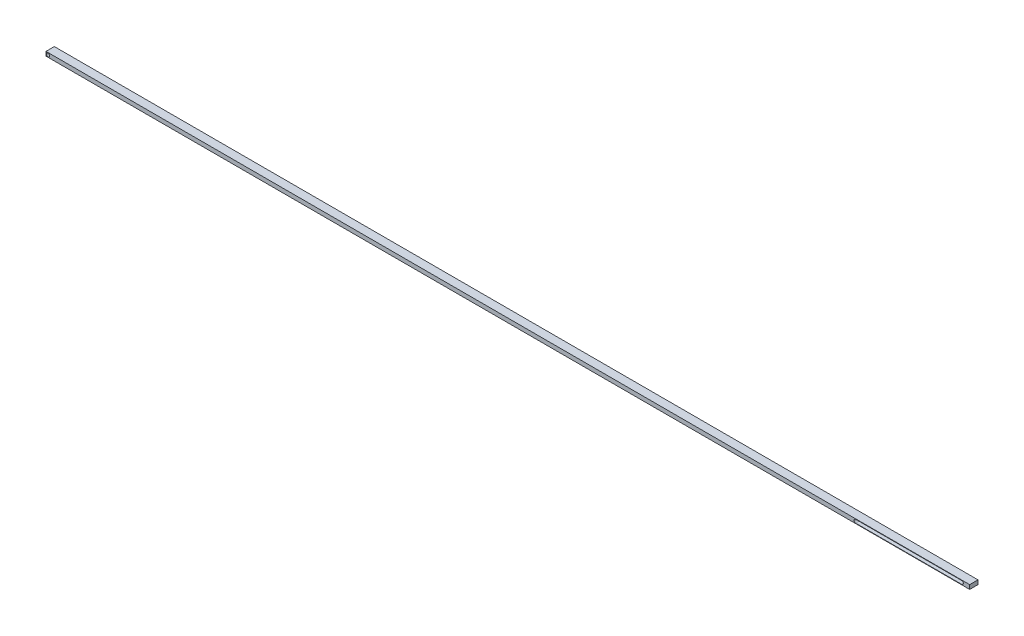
from build123d import *

# Parameters (mm, degrees)
SKIZZE1_W                       = 2220
SKIZZE1_H                       = 10
AUFSATZ_LINEAR_AUSTRAGEN1_DEPTH = 20
SKIZZE2_R                       = 4
SCHNITT_LINEAR_AUSTRAGEN1_DEPTH = 2221.112609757
SCHNITT_LINEAR_AUSTRAGEN2_DEPTH = 2221.112609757


with BuildPart() as part:
    # Skizze1 → Aufsatz-Linear austragen1 (new body)
    with BuildSketch(Plane.XY):
        with Locations((1110, 5)):
            Rectangle(SKIZZE1_W, SKIZZE1_H)
    extrude(amount=AUFSATZ_LINEAR_AUSTRAGEN1_DEPTH)

    # Skizze2 → Schnitt-Linear austragen1 (cut, through all)
    with BuildSketch(Plane.XY.offset(20)):
        with Locations((5, 5)):
            Circle(SKIZZE2_R)
    extrude(amount=-SCHNITT_LINEAR_AUSTRAGEN1_DEPTH, mode=Mode.SUBTRACT)

    # Skizze3 → Schnitt-Linear austragen2 (cut, through all)
    with BuildSketch(Plane.XY.offset(20)):
        with BuildLine():
            Line((2201, 1), (1946, 1))
            ThreePointArc((1946, 1), (1942, 5), (1946, 9))
            Line((1946, 9), (2201, 9))
            ThreePointArc((2201, 9), (2205, 5), (2201, 1))
        make_face()
    extrude(amount=-SCHNITT_LINEAR_AUSTRAGEN2_DEPTH, mode=Mode.SUBTRACT)


solid = part.part
